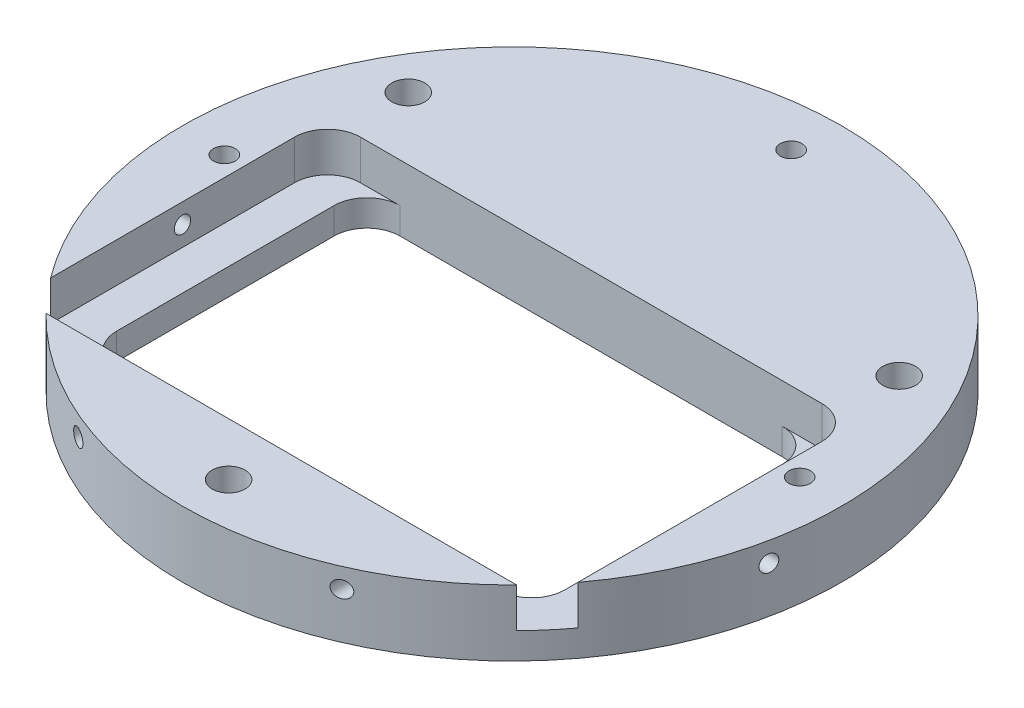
ISO-10303-21;
HEADER;
FILE_DESCRIPTION(('STEP AP214'),'2;1');
FILE_NAME('part.step','',(''),(''),'','','');
FILE_SCHEMA(('AUTOMOTIVE_DESIGN { 1 0 10303 214 1 1 1 1 }'));
ENDSEC;
DATA;
#1=APPLICATION_CONTEXT('core data for automotive mechanical design processes');
#2=APPLICATION_PROTOCOL_DEFINITION('international standard','automotive_design',2000,#1);
#3=PRODUCT_CONTEXT('',#1,'mechanical');
#4=PRODUCT('Part','Part','',(#3));
#5=PRODUCT_RELATED_PRODUCT_CATEGORY('part','',(#4));
#6=PRODUCT_DEFINITION_FORMATION('','',#4);
#7=PRODUCT_DEFINITION_CONTEXT('part definition',#1,'design');
#8=PRODUCT_DEFINITION('design','',#6,#7);
#9=PRODUCT_DEFINITION_SHAPE('','',#8);
#10=(LENGTH_UNIT() NAMED_UNIT(*) SI_UNIT(.MILLI.,.METRE.));
#11=(NAMED_UNIT(*) PLANE_ANGLE_UNIT() SI_UNIT($,.RADIAN.));
#12=(NAMED_UNIT(*) SI_UNIT($,.STERADIAN.) SOLID_ANGLE_UNIT());
#13=UNCERTAINTY_MEASURE_WITH_UNIT(LENGTH_MEASURE(1.E-05),#10,'distance_accuracy_value','');
#14=(GEOMETRIC_REPRESENTATION_CONTEXT(3) GLOBAL_UNCERTAINTY_ASSIGNED_CONTEXT((#13)) GLOBAL_UNIT_ASSIGNED_CONTEXT((#10,
#11,#12)) REPRESENTATION_CONTEXT('',''));
#15=CARTESIAN_POINT('',(0.,0.,0.));
#16=DIRECTION('',(0.,0.,1.));
#17=DIRECTION('',(1.,0.,0.));
#18=AXIS2_PLACEMENT_3D('',#15,#16,#17);
#19=CARTESIAN_POINT('',(-35.,4.,-7.));
#20=DIRECTION('',(0.,1.,0.));
#21=DIRECTION('',(0.,0.,1.));
#22=AXIS2_PLACEMENT_3D('',#19,#20,#21);
#23=CYLINDRICAL_SURFACE('',#22,5.);
#24=DIRECTION('',(0.,1.,0.));
#25=VECTOR('',#24,1.);
#26=CARTESIAN_POINT('',(-40.,4.,-6.99999999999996));
#27=LINE('',#26,#25);
#28=CARTESIAN_POINT('',(-40.,10.,-6.99999999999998));
#29=VERTEX_POINT('',#28);
#30=CARTESIAN_POINT('',(-40.,4.,-6.99999999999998));
#31=VERTEX_POINT('',#30);
#32=EDGE_CURVE('E148',#29,#31,#27,.F.);
#33=ORIENTED_EDGE('',*,*,#32,.T.);
#34=CARTESIAN_POINT('',(-35.,4.,-7.));
#35=DIRECTION('',(0.,1.,0.));
#36=DIRECTION('',(0.,0.,1.));
#37=AXIS2_PLACEMENT_3D('',#34,#35,#36);
#38=CIRCLE('',#37,5.);
#39=CARTESIAN_POINT('',(-35.,4.,-12.));
#40=VERTEX_POINT('',#39);
#41=EDGE_CURVE('E129',#31,#40,#38,.F.);
#42=ORIENTED_EDGE('',*,*,#41,.T.);
#43=DIRECTION('',(0.,1.,0.));
#44=VECTOR('',#43,1.);
#45=CARTESIAN_POINT('',(-35.,0.,-12.));
#46=LINE('',#45,#44);
#47=CARTESIAN_POINT('',(-35.,10.,-12.));
#48=VERTEX_POINT('',#47);
#49=EDGE_CURVE('E383',#40,#48,#46,.T.);
#50=ORIENTED_EDGE('',*,*,#49,.T.);
#51=CARTESIAN_POINT('',(-35.,10.,-7.));
#52=DIRECTION('',(0.,1.,0.));
#53=DIRECTION('',(0.,0.,1.));
#54=AXIS2_PLACEMENT_3D('',#51,#52,#53);
#55=CIRCLE('',#54,5.);
#56=EDGE_CURVE('E154',#29,#48,#55,.F.);
#57=ORIENTED_EDGE('',*,*,#56,.F.);
#58=EDGE_LOOP('',(#33,#42,#50,#57));
#59=FACE_BOUND('',#58,.T.);
#60=ADVANCED_FACE('F17',(#59),#23,.F.);
#61=CARTESIAN_POINT('',(35.,4.,-7.));
#62=DIRECTION('',(0.,1.,0.));
#63=DIRECTION('',(0.,0.,1.));
#64=AXIS2_PLACEMENT_3D('',#61,#62,#63);
#65=CYLINDRICAL_SURFACE('',#64,5.);
#66=DIRECTION('',(0.,1.,0.));
#67=VECTOR('',#66,1.);
#68=CARTESIAN_POINT('',(35.,0.,-12.));
#69=LINE('',#68,#67);
#70=CARTESIAN_POINT('',(35.,10.,-12.));
#71=VERTEX_POINT('',#70);
#72=CARTESIAN_POINT('',(35.,4.,-12.));
#73=VERTEX_POINT('',#72);
#74=EDGE_CURVE('E378',#71,#73,#69,.F.);
#75=ORIENTED_EDGE('',*,*,#74,.T.);
#76=CARTESIAN_POINT('',(35.,4.,-7.));
#77=DIRECTION('',(0.,1.,0.));
#78=DIRECTION('',(0.,0.,1.));
#79=AXIS2_PLACEMENT_3D('',#76,#77,#78);
#80=CIRCLE('',#79,5.);
#81=CARTESIAN_POINT('',(40.,4.,-6.99999999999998));
#82=VERTEX_POINT('',#81);
#83=EDGE_CURVE('E141',#73,#82,#80,.F.);
#84=ORIENTED_EDGE('',*,*,#83,.T.);
#85=DIRECTION('',(0.,1.,0.));
#86=VECTOR('',#85,1.);
#87=CARTESIAN_POINT('',(40.,4.,-6.99999999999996));
#88=LINE('',#87,#86);
#89=CARTESIAN_POINT('',(40.,10.,-6.99999999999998));
#90=VERTEX_POINT('',#89);
#91=EDGE_CURVE('E160',#82,#90,#88,.T.);
#92=ORIENTED_EDGE('',*,*,#91,.T.);
#93=CARTESIAN_POINT('',(35.,10.,-7.));
#94=DIRECTION('',(0.,1.,0.));
#95=DIRECTION('',(0.,0.,1.));
#96=AXIS2_PLACEMENT_3D('',#93,#94,#95);
#97=CIRCLE('',#96,5.);
#98=EDGE_CURVE('E298',#71,#90,#97,.F.);
#99=ORIENTED_EDGE('',*,*,#98,.F.);
#100=EDGE_LOOP('',(#75,#84,#92,#99));
#101=FACE_BOUND('',#100,.T.);
#102=ADVANCED_FACE('F243',(#101),#65,.F.);
#103=CARTESIAN_POINT('',(20.,7.,31.));
#104=DIRECTION('',(0.,0.,-1.));
#105=DIRECTION('',(-1.,0.,0.));
#106=AXIS2_PLACEMENT_3D('',#103,#104,#105);
#107=CYLINDRICAL_SURFACE('',#106,1.24999999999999);
#108=CARTESIAN_POINT('',(20.,7.,35.));
#109=DIRECTION('',(0.,0.,-1.));
#110=DIRECTION('',(-1.,0.,0.));
#111=AXIS2_PLACEMENT_3D('',#108,#109,#110);
#112=CIRCLE('',#111,1.24999999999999);
#113=CARTESIAN_POINT('',(18.75,7.,35.));
#114=VERTEX_POINT('',#113);
#115=EDGE_CURVE('E302',#114,#114,#112,.T.);
#116=ORIENTED_EDGE('',*,*,#115,.T.);
#117=EDGE_LOOP('',(#116));
#118=FACE_BOUND('',#117,.T.);
#119=CARTESIAN_POINT('',(21.25,6.99999999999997,45.2596674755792));
#120=CARTESIAN_POINT('',(21.2499922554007,6.9346349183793,45.259671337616));
#121=CARTESIAN_POINT('',(21.2448432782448,6.86918883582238,45.2620897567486));
#122=CARTESIAN_POINT('',(21.2244435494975,6.74014169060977,45.2716590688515));
#123=CARTESIAN_POINT('',(21.2091690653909,6.67654532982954,45.2788210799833));
#124=CARTESIAN_POINT('',(21.1692361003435,6.55326708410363,45.2975046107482));
#125=CARTESIAN_POINT('',(21.1446052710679,6.4935742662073,45.3090132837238));
#126=CARTESIAN_POINT('',(21.0869415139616,6.37939470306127,45.3358787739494));
#127=CARTESIAN_POINT('',(21.0539114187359,6.32490621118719,45.3512342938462));
#128=CARTESIAN_POINT('',(20.9791062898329,6.22015550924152,45.3858883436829));
#129=CARTESIAN_POINT('',(20.9370332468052,6.1701510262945,45.4053204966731));
#130=CARTESIAN_POINT('',(20.8463576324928,6.07784527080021,45.447022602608));
#131=CARTESIAN_POINT('',(20.7977524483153,6.03554709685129,45.469293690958));
#132=CARTESIAN_POINT('',(20.6907389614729,5.95586489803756,45.5180961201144));
#133=CARTESIAN_POINT('',(20.6318425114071,5.91926073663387,45.5448303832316));
#134=CARTESIAN_POINT('',(20.5094960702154,5.85647618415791,45.6000557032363));
#135=CARTESIAN_POINT('',(20.4460443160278,5.83029985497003,45.6285474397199));
#136=CARTESIAN_POINT('',(20.3108075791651,5.78701131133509,45.68891560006));
#137=CARTESIAN_POINT('',(20.2387658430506,5.77081785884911,45.7208780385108));
#138=CARTESIAN_POINT('',(20.0930750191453,5.7513036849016,45.7850923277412));
#139=CARTESIAN_POINT('',(20.0194254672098,5.74798673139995,45.8173442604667));
#140=CARTESIAN_POINT('',(19.8694255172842,5.75448354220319,45.8825989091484));
#141=CARTESIAN_POINT('',(19.79308756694,5.76483873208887,45.9155785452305));
#142=CARTESIAN_POINT('',(19.6429790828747,5.7995957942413,45.9799961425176));
#143=CARTESIAN_POINT('',(19.5692086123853,5.8239980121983,46.0114340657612));
#144=CARTESIAN_POINT('',(19.4278504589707,5.88599951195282,46.0712971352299));
#145=CARTESIAN_POINT('',(19.3601776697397,5.92336231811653,46.0997651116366));
#146=CARTESIAN_POINT('',(19.2320225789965,6.01069967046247,46.1533761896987));
#147=CARTESIAN_POINT('',(19.1715369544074,6.06066835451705,46.1785208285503));
#148=CARTESIAN_POINT('',(19.0638741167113,6.16838497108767,46.2230665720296));
#149=CARTESIAN_POINT('',(19.0160847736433,6.22540917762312,46.2427359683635));
#150=CARTESIAN_POINT('',(18.930907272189,6.34800106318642,46.2776714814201));
#151=CARTESIAN_POINT('',(18.893518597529,6.41356831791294,46.2929378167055));
#152=CARTESIAN_POINT('',(18.8334007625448,6.54569205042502,46.3174264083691));
#153=CARTESIAN_POINT('',(18.8097438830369,6.61175732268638,46.3270320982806));
#154=CARTESIAN_POINT('',(18.773816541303,6.74729034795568,46.3416032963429));
#155=CARTESIAN_POINT('',(18.7615150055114,6.81674826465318,46.3465814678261));
#156=CARTESIAN_POINT('',(18.753429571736,6.90554267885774,46.3498530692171));
#157=CARTESIAN_POINT('',(18.7521446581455,6.9244052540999,46.3503729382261));
#158=CARTESIAN_POINT('',(18.7504294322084,6.96217593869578,46.3510668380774));
#159=CARTESIAN_POINT('',(18.7499991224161,6.98108404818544,46.3512408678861));
#160=CARTESIAN_POINT('',(18.7500030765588,7.06631393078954,46.3512394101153));
#161=CARTESIAN_POINT('',(18.7553054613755,7.13272424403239,46.3490954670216));
#162=CARTESIAN_POINT('',(18.7763236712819,7.26369134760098,46.3405847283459));
#163=CARTESIAN_POINT('',(18.7920627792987,7.3282436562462,46.3342084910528));
#164=CARTESIAN_POINT('',(18.8332866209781,7.45344334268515,46.3174676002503));
#165=CARTESIAN_POINT('',(18.8587489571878,7.51409932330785,46.307112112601));
#166=CARTESIAN_POINT('',(18.918445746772,7.63007575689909,46.2827553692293));
#167=CARTESIAN_POINT('',(18.9526769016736,7.68539820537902,46.2687554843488));
#168=CARTESIAN_POINT('',(19.0298466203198,7.7910137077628,46.2370708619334));
#169=CARTESIAN_POINT('',(19.0730090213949,7.84111424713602,46.2192909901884));
#170=CARTESIAN_POINT('',(19.1659860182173,7.93338893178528,46.1808132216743));
#171=CARTESIAN_POINT('',(19.2158028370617,7.97556041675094,46.1601143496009));
#172=CARTESIAN_POINT('',(19.3242966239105,8.05390018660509,46.1148050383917));
#173=CARTESIAN_POINT('',(19.3833483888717,8.08944971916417,46.0900229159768));
#174=CARTESIAN_POINT('',(19.5057188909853,8.15015482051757,46.0383681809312));
#175=CARTESIAN_POINT('',(19.5690390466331,8.17530691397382,46.0114948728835));
#176=CARTESIAN_POINT('',(19.7031803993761,8.21642068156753,45.9542205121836));
#177=CARTESIAN_POINT('',(19.7742080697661,8.23155205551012,45.9237060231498));
#178=CARTESIAN_POINT('',(19.9174260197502,8.24935714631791,45.8617731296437));
#179=CARTESIAN_POINT('',(19.9896166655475,8.2520268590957,45.8303544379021));
#180=CARTESIAN_POINT('',(20.1372007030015,8.24475747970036,45.7657074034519));
#181=CARTESIAN_POINT('',(20.2125584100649,8.23413502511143,45.7324723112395));
#182=CARTESIAN_POINT('',(20.3604615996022,8.1993086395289,45.6668167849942));
#183=CARTESIAN_POINT('',(20.4330065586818,8.17510219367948,45.6343965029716));
#184=CARTESIAN_POINT('',(20.573498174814,8.11333577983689,45.5712314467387));
#185=CARTESIAN_POINT('',(20.6414200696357,8.07570975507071,45.5404958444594));
#186=CARTESIAN_POINT('',(20.7699724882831,7.98777541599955,45.4820099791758));
#187=CARTESIAN_POINT('',(20.8306054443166,7.93747134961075,45.4542587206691));
#188=CARTESIAN_POINT('',(20.9390387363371,7.82842193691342,45.4044053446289));
#189=CARTESIAN_POINT('',(20.987369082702,7.77031062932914,45.3820732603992));
#190=CARTESIAN_POINT('',(21.0733330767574,7.64514216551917,45.3422197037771));
#191=CARTESIAN_POINT('',(21.1109688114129,7.57808675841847,45.3246972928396));
#192=CARTESIAN_POINT('',(21.1706518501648,7.44380273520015,45.2968485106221));
#193=CARTESIAN_POINT('',(21.1938333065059,7.377184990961,45.2859999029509));
#194=CARTESIAN_POINT('',(21.2286573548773,7.2405035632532,45.2696862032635));
#195=CARTESIAN_POINT('',(21.2403349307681,7.17045101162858,45.2642047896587));
#196=CARTESIAN_POINT('',(21.2486691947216,7.06668804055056,45.2602922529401));
#197=CARTESIAN_POINT('',(21.2500039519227,7.03335456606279,45.2596655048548));
#198=CARTESIAN_POINT('',(21.25,6.99999999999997,45.2596674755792));
#199=B_SPLINE_CURVE_WITH_KNOTS('',3,(#119,#120,#121,#122,#123,#124,#125,#126,#127,#128,#129,
#130,#131,#132,#133,#134,#135,#136,#137,#138,#139,#140,#141,#142,#143,#144,#145,#146,#147,#148,
#149,#150,#151,#152,#153,#154,#155,#156,#157,#158,#159,#160,#161,#162,#163,#164,#165,#166,#167,
#168,#169,#170,#171,#172,#173,#174,#175,#176,#177,#178,#179,#180,#181,#182,#183,#184,#185,#186,
#187,#188,#189,#190,#191,#192,#193,#194,#195,#196,#197,#198),.UNSPECIFIED.,.T.,.F.,(4,2,2,2,2,2,
2,2,2,2,2,2,2,2,2,2,2,2,2,2,2,2,2,2,2,2,2,2,2,2,2,2,2,2,2,2,2,2,2,4),(0.,0.195993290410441,
0.392447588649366,0.588325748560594,0.78413793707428,0.98781665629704,1.19157709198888,
1.41359412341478,1.63569755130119,1.87600506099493,2.11638288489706,2.36657118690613,
2.61676564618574,2.86261636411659,3.10835296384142,3.33799712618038,3.5676298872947,
3.77904387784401,3.98987761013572,4.04660386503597,4.10333028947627,4.3021969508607,
4.50150875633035,4.7003641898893,4.89914493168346,5.10369359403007,5.30831076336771,
5.52711139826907,5.74598510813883,5.98126654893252,6.21662358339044,6.46459320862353,
6.71260875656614,6.96186238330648,7.21103260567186,7.44618609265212,7.68129365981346,
7.89426272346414,8.10658211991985,8.20659379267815),.UNSPECIFIED.);
#200=CARTESIAN_POINT('',(21.25,6.99999999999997,45.2596674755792));
#201=VERTEX_POINT('',#200);
#202=EDGE_CURVE('E230',#201,#201,#199,.T.);
#203=ORIENTED_EDGE('',*,*,#202,.F.);
#204=EDGE_LOOP('',(#203));
#205=FACE_BOUND('',#204,.T.);
#206=ADVANCED_FACE('F239',(#118,#205),#107,.F.);
#207=CARTESIAN_POINT('',(40.,7.,9.99999999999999));
#208=DIRECTION('',(-1.,0.,0.));
#209=DIRECTION('',(0.,0.,1.));
#210=AXIS2_PLACEMENT_3D('',#207,#208,#209);
#211=CYLINDRICAL_SURFACE('',#210,1.24999999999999);
#212=CARTESIAN_POINT('',(40.,7.,9.99999999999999));
#213=DIRECTION('',(-1.,0.,0.));
#214=DIRECTION('',(0.,0.,1.));
#215=AXIS2_PLACEMENT_3D('',#212,#213,#214);
#216=CIRCLE('',#215,1.24999999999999);
#217=CARTESIAN_POINT('',(40.,7.,11.25));
#218=VERTEX_POINT('',#217);
#219=EDGE_CURVE('E20',#218,#218,#216,.T.);
#220=ORIENTED_EDGE('',*,*,#219,.T.);
#221=EDGE_LOOP('',(#220));
#222=FACE_BOUND('',#221,.T.);
#223=CARTESIAN_POINT('',(49.228421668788,7.000000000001,8.75));
#224=CARTESIAN_POINT('',(49.2284212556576,6.93068005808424,8.75000298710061));
#225=CARTESIAN_POINT('',(49.2273934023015,6.86126604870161,8.75579123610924));
#226=CARTESIAN_POINT('',(49.2232960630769,6.72431971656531,8.77879583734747));
#227=CARTESIAN_POINT('',(49.2202222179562,6.6567917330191,8.79603659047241));
#228=CARTESIAN_POINT('',(49.2120927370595,6.5256990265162,8.84140575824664));
#229=CARTESIAN_POINT('',(49.2070393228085,6.46212995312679,8.86952196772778));
#230=CARTESIAN_POINT('',(49.1950521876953,6.34068490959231,8.93576899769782));
#231=CARTESIAN_POINT('',(49.1881193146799,6.28280638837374,8.9738953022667));
#232=CARTESIAN_POINT('',(49.1724616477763,6.17392523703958,9.05929944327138));
#233=CARTESIAN_POINT('',(49.1637257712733,6.12296852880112,9.10663377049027));
#234=CARTESIAN_POINT('',(49.1446717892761,6.02971147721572,9.20890523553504));
#235=CARTESIAN_POINT('',(49.1343534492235,5.98741241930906,9.26384350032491));
#236=CARTESIAN_POINT('',(49.11219603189,5.91199594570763,9.38060649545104));
#237=CARTESIAN_POINT('',(49.1003367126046,5.87902364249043,9.44252109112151));
#238=CARTESIAN_POINT('',(49.0754954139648,5.82392512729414,9.57078967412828));
#239=CARTESIAN_POINT('',(49.062513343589,5.8017997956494,9.63714402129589));
#240=CARTESIAN_POINT('',(49.0355115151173,5.76863335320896,9.77361382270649));
#241=CARTESIAN_POINT('',(49.0214778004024,5.75778841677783,9.84377420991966));
#242=CARTESIAN_POINT('',(48.992942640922,5.74809408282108,9.98482598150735));
#243=CARTESIAN_POINT('',(48.978441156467,5.74924570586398,10.0557174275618));
#244=CARTESIAN_POINT('',(48.9491860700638,5.76357837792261,10.1971793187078));
#245=CARTESIAN_POINT('',(48.9344316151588,5.77691303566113,10.2677340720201));
#246=CARTESIAN_POINT('',(48.9053001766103,5.81547058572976,10.4056034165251));
#247=CARTESIAN_POINT('',(48.8909232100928,5.8406940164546,10.4729178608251));
#248=CARTESIAN_POINT('',(48.8629921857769,5.90241911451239,10.6024712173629));
#249=CARTESIAN_POINT('',(48.8494392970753,5.93893637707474,10.6647029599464));
#250=CARTESIAN_POINT('',(48.8236529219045,6.02227806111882,10.7821396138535));
#251=CARTESIAN_POINT('',(48.8114192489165,6.06910102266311,10.8373455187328));
#252=CARTESIAN_POINT('',(48.7888860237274,6.17108435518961,10.9383384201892));
#253=CARTESIAN_POINT('',(48.7785623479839,6.22612218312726,10.9842437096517));
#254=CARTESIAN_POINT('',(48.7600502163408,6.34350710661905,11.0661317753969));
#255=CARTESIAN_POINT('',(48.7518625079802,6.4058567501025,11.1021110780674));
#256=CARTESIAN_POINT('',(48.7381315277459,6.53454727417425,11.1622340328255));
#257=CARTESIAN_POINT('',(48.7325327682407,6.60076639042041,11.1866263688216));
#258=CARTESIAN_POINT('',(48.7239595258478,6.7364230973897,11.223909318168));
#259=CARTESIAN_POINT('',(48.7209789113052,6.80585276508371,11.2368268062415));
#260=CARTESIAN_POINT('',(48.7188903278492,6.89643623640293,11.2458759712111));
#261=CARTESIAN_POINT('',(48.7185335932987,6.91711480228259,11.2474212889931));
#262=CARTESIAN_POINT('',(48.7180573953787,6.958526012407,11.2494837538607));
#263=CARTESIAN_POINT('',(48.7179379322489,6.97925865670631,11.2500008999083));
#264=CARTESIAN_POINT('',(48.7179389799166,7.06886194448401,11.2499970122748));
#265=CARTESIAN_POINT('',(48.7192592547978,7.13781977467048,11.2442838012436));
#266=CARTESIAN_POINT('',(48.7244916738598,7.2738540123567,11.2215882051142));
#267=CARTESIAN_POINT('',(48.728409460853,7.34092599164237,11.2045812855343));
#268=CARTESIAN_POINT('',(48.7386698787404,7.47110548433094,11.1598647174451));
#269=CARTESIAN_POINT('',(48.7450090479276,7.5342185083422,11.1321703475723));
#270=CARTESIAN_POINT('',(48.7598550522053,7.65482183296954,11.0669619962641));
#271=CARTESIAN_POINT('',(48.7683609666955,7.71231450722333,11.0294521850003));
#272=CARTESIAN_POINT('',(48.7873342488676,7.82087179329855,10.9452225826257));
#273=CARTESIAN_POINT('',(48.7978240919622,7.8718502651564,10.8983969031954));
#274=CARTESIAN_POINT('',(48.8203171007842,7.96526257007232,10.7971904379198));
#275=CARTESIAN_POINT('',(48.8323205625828,8.00769472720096,10.7428081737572));
#276=CARTESIAN_POINT('',(48.8577341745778,8.08386479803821,10.6266374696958));
#277=CARTESIAN_POINT('',(48.8711709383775,8.11737260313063,10.5647039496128));
#278=CARTESIAN_POINT('',(48.8987656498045,8.17350457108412,10.4362364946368));
#279=CARTESIAN_POINT('',(48.9129236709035,8.19612762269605,10.3697020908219));
#280=CARTESIAN_POINT('',(48.9418000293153,8.23024550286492,10.2325563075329));
#281=CARTESIAN_POINT('',(48.9565238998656,8.24152161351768,10.1618915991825));
#282=CARTESIAN_POINT('',(48.9858348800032,8.25187868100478,10.0196434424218));
#283=CARTESIAN_POINT('',(49.0004219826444,8.25095902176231,9.94805994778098));
#284=CARTESIAN_POINT('',(49.0291341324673,8.2368723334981,9.80557587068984));
#285=CARTESIAN_POINT('',(49.0432560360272,8.22363482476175,9.73468159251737));
#286=CARTESIAN_POINT('',(49.0705694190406,8.18511635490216,9.59605182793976));
#287=CARTESIAN_POINT('',(49.0837609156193,8.15983561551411,9.52831628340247));
#288=CARTESIAN_POINT('',(49.1087743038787,8.09812159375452,9.39854366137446));
#289=CARTESIAN_POINT('',(49.1206063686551,8.0617797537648,9.33646509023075));
#290=CARTESIAN_POINT('',(49.1427351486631,7.97884042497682,9.21928102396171));
#291=CARTESIAN_POINT('',(49.153032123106,7.93224467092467,9.16417435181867));
#292=CARTESIAN_POINT('',(49.1716983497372,7.83093193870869,9.06347985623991));
#293=CARTESIAN_POINT('',(49.1800964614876,7.77636076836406,9.01775067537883));
#294=CARTESIAN_POINT('',(49.1949986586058,7.66004524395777,8.93609738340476));
#295=CARTESIAN_POINT('',(49.2015020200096,7.59829816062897,8.90017702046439));
#296=CARTESIAN_POINT('',(49.2123855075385,7.47048236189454,8.83979879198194));
#297=CARTESIAN_POINT('',(49.2167976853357,7.40449776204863,8.8151680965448));
#298=CARTESIAN_POINT('',(49.2235559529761,7.26932881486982,8.77735234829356));
#299=CARTESIAN_POINT('',(49.2259066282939,7.20015193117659,8.76414189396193));
#300=CARTESIAN_POINT('',(49.2276127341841,7.1087718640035,8.75455003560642));
#301=CARTESIAN_POINT('',(49.2279159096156,7.08705614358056,8.75284505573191));
#302=CARTESIAN_POINT('',(49.2283204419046,7.04356337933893,8.7505695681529));
#303=CARTESIAN_POINT('',(49.2284217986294,7.02178633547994,8.74999906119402));
#304=CARTESIAN_POINT('',(49.228421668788,7.000000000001,8.75));
#305=B_SPLINE_CURVE_WITH_KNOTS('',3,(#223,#224,#225,#226,#227,#228,#229,#230,#231,#232,#233,
#234,#235,#236,#237,#238,#239,#240,#241,#242,#243,#244,#245,#246,#247,#248,#249,#250,#251,#252,
#253,#254,#255,#256,#257,#258,#259,#260,#261,#262,#263,#264,#265,#266,#267,#268,#269,#270,#271,
#272,#273,#274,#275,#276,#277,#278,#279,#280,#281,#282,#283,#284,#285,#286,#287,#288,#289,#290,
#291,#292,#293,#294,#295,#296,#297,#298,#299,#300,#301,#302,#303,#304),.UNSPECIFIED.,.T.,.F.,(4,
2,2,2,2,2,2,2,2,2,2,2,2,2,2,2,2,2,2,2,2,2,2,2,2,2,2,2,2,2,2,2,2,2,2,2,2,2,2,2,4),(0.,
0.207876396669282,0.416197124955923,0.624284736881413,0.832278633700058,1.04159127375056,
1.25093496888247,1.46337612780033,1.67583452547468,1.89192891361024,2.10804168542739,
2.32691747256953,2.54580317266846,2.76499248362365,2.98415076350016,3.2003172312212,
3.41655925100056,3.62792320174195,3.83879081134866,3.90099063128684,3.96319051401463,
4.16969617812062,4.37665192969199,4.58331290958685,4.789886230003,4.998957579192,
5.20806988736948,5.42214248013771,5.63623692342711,5.85438334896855,6.07254079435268,
6.2919542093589,6.51136358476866,6.72900621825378,6.94661205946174,7.16064719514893,
7.37476400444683,7.5854834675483,7.79573302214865,7.86106576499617,7.92639855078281),.UNSPECIFIED.);
#306=CARTESIAN_POINT('',(49.228421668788,7.000000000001,8.75));
#307=VERTEX_POINT('',#306);
#308=EDGE_CURVE('E224',#307,#307,#305,.T.);
#309=ORIENTED_EDGE('',*,*,#308,.F.);
#310=EDGE_LOOP('',(#309));
#311=FACE_BOUND('',#310,.T.);
#312=ADVANCED_FACE('F242',(#222,#311),#211,.F.);
#313=CARTESIAN_POINT('',(40.,4.,-6.99999999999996));
#314=DIRECTION('',(1.,0.,0.));
#315=DIRECTION('',(0.,0.,-1.));
#316=AXIS2_PLACEMENT_3D('',#313,#314,#315);
#317=PLANE('',#316);
#318=ORIENTED_EDGE('',*,*,#91,.F.);
#319=DIRECTION('',(0.,0.,-1.));
#320=VECTOR('',#319,1.);
#321=CARTESIAN_POINT('',(40.,4.,-7.));
#322=LINE('',#321,#320);
#323=CARTESIAN_POINT('',(40.,4.,30.));
#324=VERTEX_POINT('',#323);
#325=EDGE_CURVE('E155',#82,#324,#322,.F.);
#326=ORIENTED_EDGE('',*,*,#325,.T.);
#327=DIRECTION('',(0.,-1.,0.));
#328=VECTOR('',#327,1.);
#329=CARTESIAN_POINT('',(40.,10.,30.));
#330=LINE('',#329,#328);
#331=CARTESIAN_POINT('',(40.,10.,30.));
#332=VERTEX_POINT('',#331);
#333=EDGE_CURVE('E362',#332,#324,#330,.T.);
#334=ORIENTED_EDGE('',*,*,#333,.F.);
#335=DIRECTION('',(0.,0.,1.));
#336=VECTOR('',#335,1.);
#337=CARTESIAN_POINT('',(40.,10.,0.));
#338=LINE('',#337,#336);
#339=EDGE_CURVE('E297',#90,#332,#338,.T.);
#340=ORIENTED_EDGE('',*,*,#339,.F.);
#341=EDGE_LOOP('',(#318,#326,#334,#340));
#342=FACE_BOUND('',#341,.T.);
#343=ORIENTED_EDGE('',*,*,#219,.F.);
#344=EDGE_LOOP('',(#343));
#345=FACE_BOUND('',#344,.T.);
#346=ADVANCED_FACE('F315',(#342,#345),#317,.F.);
#347=CARTESIAN_POINT('',(0.,10.,0.));
#348=DIRECTION('',(0.,1.,0.));
#349=DIRECTION('',(0.,0.,1.));
#350=AXIS2_PLACEMENT_3D('',#347,#348,#349);
#351=PLANE('',#350);
#352=CARTESIAN_POINT('',(0.,10.,0.));
#353=DIRECTION('',(0.,-1.,0.));
#354=DIRECTION('',(0.,0.,-1.));
#355=AXIS2_PLACEMENT_3D('',#352,#353,#354);
#356=CIRCLE('',#355,50.);
#357=CARTESIAN_POINT('',(35.7071421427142,10.,35.));
#358=VERTEX_POINT('',#357);
#359=CARTESIAN_POINT('',(-35.7071421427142,10.,35.));
#360=VERTEX_POINT('',#359);
#361=EDGE_CURVE('E358',#358,#360,#356,.T.);
#362=ORIENTED_EDGE('',*,*,#361,.F.);
#363=DIRECTION('',(1.,0.,0.));
#364=VECTOR('',#363,1.);
#365=CARTESIAN_POINT('',(-40.,10.,35.));
#366=LINE('',#365,#364);
#367=EDGE_CURVE('E304',#358,#360,#366,.F.);
#368=ORIENTED_EDGE('',*,*,#367,.T.);
#369=EDGE_LOOP('',(#362,#368));
#370=FACE_BOUND('',#369,.T.);
#371=CARTESIAN_POINT('',(0.,10.,43.));
#372=DIRECTION('',(0.,1.,0.));
#373=DIRECTION('',(0.,0.,1.));
#374=AXIS2_PLACEMENT_3D('',#371,#372,#373);
#375=CIRCLE('',#374,2.5);
#376=CARTESIAN_POINT('',(0.,10.,45.5));
#377=VERTEX_POINT('',#376);
#378=EDGE_CURVE('E402',#377,#377,#375,.F.);
#379=ORIENTED_EDGE('',*,*,#378,.T.);
#380=EDGE_LOOP('',(#379));
#381=FACE_BOUND('',#380,.T.);
#382=ADVANCED_FACE('F317',(#370,#381),#351,.T.);
#383=CARTESIAN_POINT('',(-40.,4.,35.));
#384=DIRECTION('',(0.,0.,1.));
#385=DIRECTION('',(1.,0.,0.));
#386=AXIS2_PLACEMENT_3D('',#383,#384,#385);
#387=PLANE('',#386);
#388=DIRECTION('',(0.,-1.,0.));
#389=VECTOR('',#388,1.);
#390=CARTESIAN_POINT('',(35.7071421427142,10.,35.));
#391=LINE('',#390,#389);
#392=CARTESIAN_POINT('',(35.7071421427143,4.,35.));
#393=VERTEX_POINT('',#392);
#394=EDGE_CURVE('E359',#393,#358,#391,.F.);
#395=ORIENTED_EDGE('',*,*,#394,.F.);
#396=DIRECTION('',(1.,0.,0.));
#397=VECTOR('',#396,1.);
#398=CARTESIAN_POINT('',(-35.,4.,35.));
#399=LINE('',#398,#397);
#400=CARTESIAN_POINT('',(-35.7071421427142,4.,35.));
#401=VERTEX_POINT('',#400);
#402=EDGE_CURVE('E142',#393,#401,#399,.F.);
#403=ORIENTED_EDGE('',*,*,#402,.T.);
#404=DIRECTION('',(0.,-1.,0.));
#405=VECTOR('',#404,1.);
#406=CARTESIAN_POINT('',(-35.7071421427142,10.,35.));
#407=LINE('',#406,#405);
#408=EDGE_CURVE('E357',#360,#401,#407,.T.);
#409=ORIENTED_EDGE('',*,*,#408,.F.);
#410=ORIENTED_EDGE('',*,*,#367,.F.);
#411=EDGE_LOOP('',(#395,#403,#409,#410));
#412=FACE_BOUND('',#411,.T.);
#413=ORIENTED_EDGE('',*,*,#115,.F.);
#414=EDGE_LOOP('',(#413));
#415=FACE_BOUND('',#414,.T.);
#416=CARTESIAN_POINT('',(-20.,7.,35.));
#417=DIRECTION('',(0.,0.,-1.));
#418=DIRECTION('',(-1.,0.,0.));
#419=AXIS2_PLACEMENT_3D('',#416,#417,#418);
#420=CIRCLE('',#419,1.24999999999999);
#421=CARTESIAN_POINT('',(-21.25,7.,35.));
#422=VERTEX_POINT('',#421);
#423=EDGE_CURVE('E285',#422,#422,#420,.F.);
#424=ORIENTED_EDGE('',*,*,#423,.T.);
#425=EDGE_LOOP('',(#424));
#426=FACE_BOUND('',#425,.T.);
#427=ADVANCED_FACE('F323',(#412,#415,#426),#387,.F.);
#428=CARTESIAN_POINT('',(-35.,4.,-7.));
#429=DIRECTION('',(0.,-1.,0.));
#430=DIRECTION('',(0.,0.,-1.));
#431=AXIS2_PLACEMENT_3D('',#428,#429,#430);
#432=PLANE('',#431);
#433=ORIENTED_EDGE('',*,*,#83,.F.);
#434=DIRECTION('',(-1.,0.,0.));
#435=VECTOR('',#434,1.);
#436=CARTESIAN_POINT('',(-29.,4.,-12.));
#437=LINE('',#436,#435);
#438=CARTESIAN_POINT('',(29.,4.,-12.));
#439=VERTEX_POINT('',#438);
#440=EDGE_CURVE('E375',#73,#439,#437,.T.);
#441=ORIENTED_EDGE('',*,*,#440,.T.);
#442=CARTESIAN_POINT('',(29.,4.,-7.));
#443=DIRECTION('',(0.,1.,0.));
#444=DIRECTION('',(0.,0.,1.));
#445=AXIS2_PLACEMENT_3D('',#442,#443,#444);
#446=CIRCLE('',#445,5.);
#447=CARTESIAN_POINT('',(34.,4.,-6.99999999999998));
#448=VERTEX_POINT('',#447);
#449=EDGE_CURVE('E237',#439,#448,#446,.F.);
#450=ORIENTED_EDGE('',*,*,#449,.T.);
#451=DIRECTION('',(0.,0.,-1.));
#452=VECTOR('',#451,1.);
#453=CARTESIAN_POINT('',(34.,4.,-6.99999999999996));
#454=LINE('',#453,#452);
#455=CARTESIAN_POINT('',(34.,4.,26.));
#456=VERTEX_POINT('',#455);
#457=EDGE_CURVE('E372',#448,#456,#454,.F.);
#458=ORIENTED_EDGE('',*,*,#457,.T.);
#459=CARTESIAN_POINT('',(29.,4.,26.));
#460=DIRECTION('',(0.,1.,0.));
#461=DIRECTION('',(0.,0.,1.));
#462=AXIS2_PLACEMENT_3D('',#459,#460,#461);
#463=CIRCLE('',#462,5.);
#464=CARTESIAN_POINT('',(29.,4.,31.));
#465=VERTEX_POINT('',#464);
#466=EDGE_CURVE('E399',#456,#465,#463,.F.);
#467=ORIENTED_EDGE('',*,*,#466,.T.);
#468=DIRECTION('',(1.,0.,0.));
#469=VECTOR('',#468,1.);
#470=CARTESIAN_POINT('',(-29.,4.,31.));
#471=LINE('',#470,#469);
#472=CARTESIAN_POINT('',(-29.,4.,31.));
#473=VERTEX_POINT('',#472);
#474=EDGE_CURVE('E390',#465,#473,#471,.F.);
#475=ORIENTED_EDGE('',*,*,#474,.T.);
#476=CARTESIAN_POINT('',(-29.,4.,26.));
#477=DIRECTION('',(0.,1.,0.));
#478=DIRECTION('',(0.,0.,1.));
#479=AXIS2_PLACEMENT_3D('',#476,#477,#478);
#480=CIRCLE('',#479,5.);
#481=CARTESIAN_POINT('',(-34.,4.,26.));
#482=VERTEX_POINT('',#481);
#483=EDGE_CURVE('E396',#473,#482,#480,.F.);
#484=ORIENTED_EDGE('',*,*,#483,.T.);
#485=DIRECTION('',(0.,0.,1.));
#486=VECTOR('',#485,1.);
#487=CARTESIAN_POINT('',(-34.,4.,-6.99999999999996));
#488=LINE('',#487,#486);
#489=CARTESIAN_POINT('',(-34.,4.,-6.99999999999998));
#490=VERTEX_POINT('',#489);
#491=EDGE_CURVE('E387',#482,#490,#488,.F.);
#492=ORIENTED_EDGE('',*,*,#491,.T.);
#493=CARTESIAN_POINT('',(-29.,4.,-7.));
#494=DIRECTION('',(0.,1.,0.));
#495=DIRECTION('',(0.,0.,1.));
#496=AXIS2_PLACEMENT_3D('',#493,#494,#495);
#497=CIRCLE('',#496,5.);
#498=CARTESIAN_POINT('',(-29.,4.,-12.));
#499=VERTEX_POINT('',#498);
#500=EDGE_CURVE('E489',#490,#499,#497,.F.);
#501=ORIENTED_EDGE('',*,*,#500,.T.);
#502=DIRECTION('',(-1.,0.,0.));
#503=VECTOR('',#502,1.);
#504=CARTESIAN_POINT('',(-29.,4.,-12.));
#505=LINE('',#504,#503);
#506=EDGE_CURVE('E136',#499,#40,#505,.T.);
#507=ORIENTED_EDGE('',*,*,#506,.T.);
#508=ORIENTED_EDGE('',*,*,#41,.F.);
#509=DIRECTION('',(0.,0.,1.));
#510=VECTOR('',#509,1.);
#511=CARTESIAN_POINT('',(-40.,4.,-6.99999999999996));
#512=LINE('',#511,#510);
#513=CARTESIAN_POINT('',(-40.,4.,30.));
#514=VERTEX_POINT('',#513);
#515=EDGE_CURVE('E133',#31,#514,#512,.T.);
#516=ORIENTED_EDGE('',*,*,#515,.T.);
#517=CARTESIAN_POINT('',(0.,4.,0.));
#518=DIRECTION('',(0.,-1.,0.));
#519=DIRECTION('',(0.,0.,-1.));
#520=AXIS2_PLACEMENT_3D('',#517,#518,#519);
#521=CIRCLE('',#520,50.);
#522=EDGE_CURVE('E353',#401,#514,#521,.T.);
#523=ORIENTED_EDGE('',*,*,#522,.F.);
#524=ORIENTED_EDGE('',*,*,#402,.F.);
#525=CARTESIAN_POINT('',(0.,4.,0.));
#526=DIRECTION('',(0.,-1.,0.));
#527=DIRECTION('',(0.,0.,-1.));
#528=AXIS2_PLACEMENT_3D('',#525,#526,#527);
#529=CIRCLE('',#528,50.);
#530=EDGE_CURVE('E360',#324,#393,#529,.T.);
#531=ORIENTED_EDGE('',*,*,#530,.F.);
#532=ORIENTED_EDGE('',*,*,#325,.F.);
#533=EDGE_LOOP('',(#433,#441,#450,#458,#467,#475,#484,#492,#501,#507,#508,#516,#523,#524,#531,#532));
#534=FACE_BOUND('',#533,.T.);
#535=ADVANCED_FACE('F131',(#534),#432,.F.);
#536=CARTESIAN_POINT('',(-40.,4.,-6.99999999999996));
#537=DIRECTION('',(-1.,0.,0.));
#538=DIRECTION('',(0.,0.,1.));
#539=AXIS2_PLACEMENT_3D('',#536,#537,#538);
#540=PLANE('',#539);
#541=ORIENTED_EDGE('',*,*,#32,.F.);
#542=DIRECTION('',(0.,0.,1.));
#543=VECTOR('',#542,1.);
#544=CARTESIAN_POINT('',(-40.,10.,0.));
#545=LINE('',#544,#543);
#546=CARTESIAN_POINT('',(-40.,10.,30.));
#547=VERTEX_POINT('',#546);
#548=EDGE_CURVE('E151',#547,#29,#545,.F.);
#549=ORIENTED_EDGE('',*,*,#548,.F.);
#550=DIRECTION('',(0.,-1.,0.));
#551=VECTOR('',#550,1.);
#552=CARTESIAN_POINT('',(-40.,10.,30.));
#553=LINE('',#552,#551);
#554=EDGE_CURVE('E150',#514,#547,#553,.F.);
#555=ORIENTED_EDGE('',*,*,#554,.F.);
#556=ORIENTED_EDGE('',*,*,#515,.F.);
#557=EDGE_LOOP('',(#541,#549,#555,#556));
#558=FACE_BOUND('',#557,.T.);
#559=CARTESIAN_POINT('',(-40.,7.,10.));
#560=DIRECTION('',(1.,0.,0.));
#561=DIRECTION('',(0.,0.,-1.));
#562=AXIS2_PLACEMENT_3D('',#559,#560,#561);
#563=CIRCLE('',#562,1.24999999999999);
#564=CARTESIAN_POINT('',(-40.,7.,8.75000000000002));
#565=VERTEX_POINT('',#564);
#566=EDGE_CURVE('E291',#565,#565,#563,.F.);
#567=ORIENTED_EDGE('',*,*,#566,.T.);
#568=EDGE_LOOP('',(#567));
#569=FACE_BOUND('',#568,.T.);
#570=ADVANCED_FACE('F145',(#558,#569),#540,.F.);
#571=CARTESIAN_POINT('',(0.,10.,0.));
#572=DIRECTION('',(0.,1.,0.));
#573=DIRECTION('',(0.,0.,1.));
#574=AXIS2_PLACEMENT_3D('',#571,#572,#573);
#575=PLANE('',#574);
#576=ORIENTED_EDGE('',*,*,#339,.T.);
#577=CARTESIAN_POINT('',(0.,10.,0.));
#578=DIRECTION('',(0.,-1.,0.));
#579=DIRECTION('',(0.,0.,-1.));
#580=AXIS2_PLACEMENT_3D('',#577,#578,#579);
#581=CIRCLE('',#580,50.);
#582=EDGE_CURVE('E350',#547,#332,#581,.T.);
#583=ORIENTED_EDGE('',*,*,#582,.F.);
#584=ORIENTED_EDGE('',*,*,#548,.T.);
#585=ORIENTED_EDGE('',*,*,#56,.T.);
#586=DIRECTION('',(-1.,0.,0.));
#587=VECTOR('',#586,1.);
#588=CARTESIAN_POINT('',(-29.,10.,-12.));
#589=LINE('',#588,#587);
#590=EDGE_CURVE('E380',#48,#71,#589,.F.);
#591=ORIENTED_EDGE('',*,*,#590,.T.);
#592=ORIENTED_EDGE('',*,*,#98,.T.);
#593=EDGE_LOOP('',(#576,#583,#584,#585,#591,#592));
#594=FACE_BOUND('',#593,.T.);
#595=CARTESIAN_POINT('',(37.2390923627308,10.,-21.5000000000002));
#596=DIRECTION('',(0.,1.,0.));
#597=DIRECTION('',(0.,0.,1.));
#598=AXIS2_PLACEMENT_3D('',#595,#596,#597);
#599=CIRCLE('',#598,2.49999999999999);
#600=CARTESIAN_POINT('',(37.2390923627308,10.,-19.0000000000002));
#601=VERTEX_POINT('',#600);
#602=EDGE_CURVE('E424',#601,#601,#599,.F.);
#603=ORIENTED_EDGE('',*,*,#602,.T.);
#604=EDGE_LOOP('',(#603));
#605=FACE_BOUND('',#604,.T.);
#606=CARTESIAN_POINT('',(-37.2390923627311,10.,-21.4999999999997));
#607=DIRECTION('',(0.,1.,0.));
#608=DIRECTION('',(0.,0.,1.));
#609=AXIS2_PLACEMENT_3D('',#606,#607,#608);
#610=CIRCLE('',#609,2.49999999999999);
#611=CARTESIAN_POINT('',(-37.2390923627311,10.,-18.9999999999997));
#612=VERTEX_POINT('',#611);
#613=EDGE_CURVE('E428',#612,#612,#610,.F.);
#614=ORIENTED_EDGE('',*,*,#613,.T.);
#615=EDGE_LOOP('',(#614));
#616=FACE_BOUND('',#615,.T.);
#617=CARTESIAN_POINT('',(-0.648760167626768,10.,-42.9951056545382));
#618=DIRECTION('',(0.,1.,0.));
#619=DIRECTION('',(0.,0.,1.));
#620=AXIS2_PLACEMENT_3D('',#617,#618,#619);
#621=CIRCLE('',#620,1.65);
#622=CARTESIAN_POINT('',(-0.648760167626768,10.,-41.3451056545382));
#623=VERTEX_POINT('',#622);
#624=EDGE_CURVE('E288',#623,#623,#621,.F.);
#625=ORIENTED_EDGE('',*,*,#624,.T.);
#626=EDGE_LOOP('',(#625));
#627=FACE_BOUND('',#626,.T.);
#628=CARTESIAN_POINT('',(-42.9951056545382,10.,0.648760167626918));
#629=DIRECTION('',(0.,1.,0.));
#630=DIRECTION('',(0.,0.,1.));
#631=AXIS2_PLACEMENT_3D('',#628,#629,#630);
#632=CIRCLE('',#631,1.65);
#633=CARTESIAN_POINT('',(-42.9951056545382,10.,2.29876016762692));
#634=VERTEX_POINT('',#633);
#635=EDGE_CURVE('E284',#634,#634,#632,.F.);
#636=ORIENTED_EDGE('',*,*,#635,.T.);
#637=EDGE_LOOP('',(#636));
#638=FACE_BOUND('',#637,.T.);
#639=CARTESIAN_POINT('',(42.9951056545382,10.,-0.648760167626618));
#640=DIRECTION('',(0.,1.,0.));
#641=DIRECTION('',(0.,0.,1.));
#642=AXIS2_PLACEMENT_3D('',#639,#640,#641);
#643=CIRCLE('',#642,1.65);
#644=CARTESIAN_POINT('',(42.9951056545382,10.,1.00123983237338));
#645=VERTEX_POINT('',#644);
#646=EDGE_CURVE('E282',#645,#645,#643,.F.);
#647=ORIENTED_EDGE('',*,*,#646,.T.);
#648=EDGE_LOOP('',(#647));
#649=FACE_BOUND('',#648,.T.);
#650=ADVANCED_FACE('F334',(#594,#605,#616,#627,#638,#649),#575,.T.);
#651=CARTESIAN_POINT('',(-40.,7.,10.));
#652=DIRECTION('',(1.,0.,0.));
#653=DIRECTION('',(0.,0.,-1.));
#654=AXIS2_PLACEMENT_3D('',#651,#652,#653);
#655=CYLINDRICAL_SURFACE('',#654,1.24999999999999);
#656=ORIENTED_EDGE('',*,*,#566,.F.);
#657=EDGE_LOOP('',(#656));
#658=FACE_BOUND('',#657,.T.);
#659=CARTESIAN_POINT('',(-48.7179381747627,7.00000000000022,11.25));
#660=CARTESIAN_POINT('',(-48.7179389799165,6.93113805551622,11.2499970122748));
#661=CARTESIAN_POINT('',(-48.7192592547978,6.86218022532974,11.2442838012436));
#662=CARTESIAN_POINT('',(-48.7244916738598,6.72614598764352,11.2215882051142));
#663=CARTESIAN_POINT('',(-48.728409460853,6.65907400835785,11.2045812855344));
#664=CARTESIAN_POINT('',(-48.7386698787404,6.52889451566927,11.1598647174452));
#665=CARTESIAN_POINT('',(-48.7450090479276,6.465781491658,11.1321703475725));
#666=CARTESIAN_POINT('',(-48.7598550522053,6.34517816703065,11.0669619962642));
#667=CARTESIAN_POINT('',(-48.7683609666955,6.28768549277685,11.0294521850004));
#668=CARTESIAN_POINT('',(-48.7873342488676,6.17912820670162,10.9452225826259));
#669=CARTESIAN_POINT('',(-48.7978240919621,6.12814973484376,10.8983969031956));
#670=CARTESIAN_POINT('',(-48.8203171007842,6.03473742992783,10.79719043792));
#671=CARTESIAN_POINT('',(-48.8323205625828,5.99230527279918,10.7428081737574));
#672=CARTESIAN_POINT('',(-48.8577341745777,5.9161352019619,10.626637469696));
#673=CARTESIAN_POINT('',(-48.8711709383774,5.88262739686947,10.564703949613));
#674=CARTESIAN_POINT('',(-48.8987656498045,5.82649542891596,10.436236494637));
#675=CARTESIAN_POINT('',(-48.9129236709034,5.80387237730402,10.3697020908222));
#676=CARTESIAN_POINT('',(-48.9418000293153,5.76975449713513,10.2325563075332));
#677=CARTESIAN_POINT('',(-48.9565238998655,5.75847838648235,10.1618915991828));
#678=CARTESIAN_POINT('',(-48.9858348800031,5.74812131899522,10.0196434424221));
#679=CARTESIAN_POINT('',(-49.0004219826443,5.74904097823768,9.94805994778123));
#680=CARTESIAN_POINT('',(-49.0291341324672,5.76312766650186,9.8055758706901));
#681=CARTESIAN_POINT('',(-49.0432560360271,5.77636517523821,9.73468159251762));
#682=CARTESIAN_POINT('',(-49.0705694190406,5.81488364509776,9.59605182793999));
#683=CARTESIAN_POINT('',(-49.0837609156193,5.8401643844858,9.5283162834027));
#684=CARTESIAN_POINT('',(-49.1087743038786,5.90187840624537,9.39854366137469));
#685=CARTESIAN_POINT('',(-49.1206063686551,5.93822024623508,9.33646509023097));
#686=CARTESIAN_POINT('',(-49.1427351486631,6.02115957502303,9.21928102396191));
#687=CARTESIAN_POINT('',(-49.153032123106,6.06775532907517,9.16417435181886));
#688=CARTESIAN_POINT('',(-49.1716983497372,6.16906806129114,9.06347985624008));
#689=CARTESIAN_POINT('',(-49.1800964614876,6.22363923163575,9.017750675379));
#690=CARTESIAN_POINT('',(-49.1949986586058,6.33995475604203,8.93609738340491));
#691=CARTESIAN_POINT('',(-49.2015020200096,6.40170183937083,8.90017702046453));
#692=CARTESIAN_POINT('',(-49.2123855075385,6.52951763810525,8.83979879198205));
#693=CARTESIAN_POINT('',(-49.2167976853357,6.59550223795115,8.81516809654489));
#694=CARTESIAN_POINT('',(-49.223555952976,6.73067118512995,8.77735234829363));
#695=CARTESIAN_POINT('',(-49.2259066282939,6.79984806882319,8.76414189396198));
#696=CARTESIAN_POINT('',(-49.227612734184,6.89122813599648,8.75455003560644));
#697=CARTESIAN_POINT('',(-49.2279159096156,6.91294385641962,8.75284505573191));
#698=CARTESIAN_POINT('',(-49.2283204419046,6.95643662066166,8.7505695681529));
#699=CARTESIAN_POINT('',(-49.2284217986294,6.97821366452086,8.74999906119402));
#700=CARTESIAN_POINT('',(-49.2284212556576,7.06931994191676,8.75000298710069));
#701=CARTESIAN_POINT('',(-49.2273934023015,7.13873395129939,8.75579123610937));
#702=CARTESIAN_POINT('',(-49.2232960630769,7.27568028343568,8.77879583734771));
#703=CARTESIAN_POINT('',(-49.2202222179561,7.34320826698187,8.79603659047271));
#704=CARTESIAN_POINT('',(-49.2120927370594,7.47430097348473,8.84140575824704));
#705=CARTESIAN_POINT('',(-49.2070393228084,7.53787004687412,8.86952196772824));
#706=CARTESIAN_POINT('',(-49.1950521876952,7.65931509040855,8.93576899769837));
#707=CARTESIAN_POINT('',(-49.1881193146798,7.71719361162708,8.9738953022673));
#708=CARTESIAN_POINT('',(-49.1724616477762,7.82607476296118,9.05929944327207));
#709=CARTESIAN_POINT('',(-49.1637257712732,7.8770314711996,9.106633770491));
#710=CARTESIAN_POINT('',(-49.1446717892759,7.97028852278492,9.20890523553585));
#711=CARTESIAN_POINT('',(-49.1343534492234,8.01258758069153,9.26384350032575));
#712=CARTESIAN_POINT('',(-49.1121960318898,8.08800405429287,9.38060649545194));
#713=CARTESIAN_POINT('',(-49.1003367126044,8.12097635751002,9.44252109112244));
#714=CARTESIAN_POINT('',(-49.0754954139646,8.17607487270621,9.57078967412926));
#715=CARTESIAN_POINT('',(-49.0625133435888,8.1982002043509,9.63714402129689));
#716=CARTESIAN_POINT('',(-49.0355115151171,8.23136664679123,9.77361382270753));
#717=CARTESIAN_POINT('',(-49.0214778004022,8.2422115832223,9.8437742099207));
#718=CARTESIAN_POINT('',(-48.9929426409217,8.25190591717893,9.9848259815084));
#719=CARTESIAN_POINT('',(-48.9784411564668,8.25075429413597,10.0557174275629));
#720=CARTESIAN_POINT('',(-48.9491860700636,8.23642162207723,10.1971793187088));
#721=CARTESIAN_POINT('',(-48.9344316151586,8.22308696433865,10.2677340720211));
#722=CARTESIAN_POINT('',(-48.90530017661,8.1845294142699,10.4056034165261));
#723=CARTESIAN_POINT('',(-48.8909232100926,8.159305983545,10.4729178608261));
#724=CARTESIAN_POINT('',(-48.8629921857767,8.0975808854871,10.6024712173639));
#725=CARTESIAN_POINT('',(-48.8494392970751,8.0610636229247,10.6647029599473));
#726=CARTESIAN_POINT('',(-48.8236529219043,7.97772193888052,10.7821396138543));
#727=CARTESIAN_POINT('',(-48.8114192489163,7.93089897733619,10.8373455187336));
#728=CARTESIAN_POINT('',(-48.7888860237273,7.82891564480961,10.93833842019));
#729=CARTESIAN_POINT('',(-48.7785623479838,7.77387781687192,10.9842437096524));
#730=CARTESIAN_POINT('',(-48.7600502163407,7.65649289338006,11.0661317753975));
#731=CARTESIAN_POINT('',(-48.7518625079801,7.59414324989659,11.1021110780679));
#732=CARTESIAN_POINT('',(-48.7381315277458,7.46545272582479,11.1622340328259));
#733=CARTESIAN_POINT('',(-48.7325327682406,7.39923360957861,11.186626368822));
#734=CARTESIAN_POINT('',(-48.7239595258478,7.2635769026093,11.2239093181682));
#735=CARTESIAN_POINT('',(-48.7209789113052,7.19414723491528,11.2368268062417));
#736=CARTESIAN_POINT('',(-48.7188903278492,7.10356376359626,11.2458759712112));
#737=CARTESIAN_POINT('',(-48.7185335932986,7.08288519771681,11.2474212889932));
#738=CARTESIAN_POINT('',(-48.7180573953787,7.04147398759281,11.2494837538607));
#739=CARTESIAN_POINT('',(-48.7179379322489,7.0207413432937,11.2500008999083));
#740=CARTESIAN_POINT('',(-48.7179381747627,7.00000000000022,11.25));
#741=B_SPLINE_CURVE_WITH_KNOTS('',3,(#659,#660,#661,#662,#663,#664,#665,#666,#667,#668,#669,
#670,#671,#672,#673,#674,#675,#676,#677,#678,#679,#680,#681,#682,#683,#684,#685,#686,#687,#688,
#689,#690,#691,#692,#693,#694,#695,#696,#697,#698,#699,#700,#701,#702,#703,#704,#705,#706,#707,
#708,#709,#710,#711,#712,#713,#714,#715,#716,#717,#718,#719,#720,#721,#722,#723,#724,#725,#726,
#727,#728,#729,#730,#731,#732,#733,#734,#735,#736,#737,#738,#739,#740),.UNSPECIFIED.,.T.,.F.,(4,
2,2,2,2,2,2,2,2,2,2,2,2,2,2,2,2,2,2,2,2,2,2,2,2,2,2,2,2,2,2,2,2,2,2,2,2,2,2,2,4),(0.,
0.206505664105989,0.413461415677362,0.62012239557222,0.826695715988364,1.03576706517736,
1.24487937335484,1.45895196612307,1.67304640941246,1.89119283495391,2.10935028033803,
2.32876369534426,2.54817307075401,2.76581570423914,2.98342154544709,3.19745668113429,
3.41157349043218,3.62229295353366,3.83254250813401,3.89787525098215,3.9632080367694,
4.17108443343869,4.37940516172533,4.58749277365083,4.79548667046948,5.00479931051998,
5.2141430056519,5.42658416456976,5.63904256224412,5.85513695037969,6.07124972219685,
6.290125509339,6.50901120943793,6.72820052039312,6.94735880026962,7.16352526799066,
7.37976728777,7.59113123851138,7.80199884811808,7.86419866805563,7.92639855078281),.UNSPECIFIED.);
#742=CARTESIAN_POINT('',(-48.7179381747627,7.00000000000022,11.25));
#743=VERTEX_POINT('',#742);
#744=EDGE_CURVE('E203',#743,#743,#741,.T.);
#745=ORIENTED_EDGE('',*,*,#744,.F.);
#746=EDGE_LOOP('',(#745));
#747=FACE_BOUND('',#746,.T.);
#748=ADVANCED_FACE('F336',(#658,#747),#655,.F.);
#749=CARTESIAN_POINT('',(-20.,7.,31.));
#750=DIRECTION('',(0.,0.,-1.));
#751=DIRECTION('',(-1.,0.,0.));
#752=AXIS2_PLACEMENT_3D('',#749,#750,#751);
#753=CYLINDRICAL_SURFACE('',#752,1.24999999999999);
#754=ORIENTED_EDGE('',*,*,#423,.F.);
#755=EDGE_LOOP('',(#754));
#756=FACE_BOUND('',#755,.T.);
#757=CARTESIAN_POINT('',(-18.75,7.00000000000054,46.3512405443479));
#758=CARTESIAN_POINT('',(-18.7500030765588,6.93368606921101,46.3512394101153));
#759=CARTESIAN_POINT('',(-18.7553054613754,6.86727575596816,46.3490954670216));
#760=CARTESIAN_POINT('',(-18.7763236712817,6.73630865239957,46.3405847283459));
#761=CARTESIAN_POINT('',(-18.7920627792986,6.67175634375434,46.3342084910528));
#762=CARTESIAN_POINT('',(-18.8332866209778,6.54655665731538,46.3174676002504));
#763=CARTESIAN_POINT('',(-18.8587489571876,6.48590067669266,46.3071121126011));
#764=CARTESIAN_POINT('',(-18.9184457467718,6.3699242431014,46.2827553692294));
#765=CARTESIAN_POINT('',(-18.9526769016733,6.31460179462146,46.2687554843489));
#766=CARTESIAN_POINT('',(-19.0298466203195,6.20898629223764,46.2370708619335));
#767=CARTESIAN_POINT('',(-19.0730090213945,6.1588857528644,46.2192909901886));
#768=CARTESIAN_POINT('',(-19.1659860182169,6.06661106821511,46.1808132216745));
#769=CARTESIAN_POINT('',(-19.2158028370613,6.02443958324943,46.1601143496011));
#770=CARTESIAN_POINT('',(-19.32429662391,5.94609981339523,46.1148050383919));
#771=CARTESIAN_POINT('',(-19.3833483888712,5.91055028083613,46.090022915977));
#772=CARTESIAN_POINT('',(-19.5057188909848,5.84984517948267,46.0383681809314));
#773=CARTESIAN_POINT('',(-19.5690390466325,5.82469308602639,46.0114948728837));
#774=CARTESIAN_POINT('',(-19.7031803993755,5.78357931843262,45.9542205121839));
#775=CARTESIAN_POINT('',(-19.7742080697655,5.76844794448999,45.9237060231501));
#776=CARTESIAN_POINT('',(-19.9174260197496,5.75064285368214,45.861773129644));
#777=CARTESIAN_POINT('',(-19.9896166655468,5.7479731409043,45.8303544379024));
#778=CARTESIAN_POINT('',(-20.1372007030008,5.75524252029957,45.7657074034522));
#779=CARTESIAN_POINT('',(-20.2125584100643,5.76586497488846,45.7324723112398));
#780=CARTESIAN_POINT('',(-20.3604615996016,5.8006913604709,45.6668167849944));
#781=CARTESIAN_POINT('',(-20.4330065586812,5.82489780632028,45.6343965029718));
#782=CARTESIAN_POINT('',(-20.5734981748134,5.8866642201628,45.5712314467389));
#783=CARTESIAN_POINT('',(-20.6414200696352,5.92429024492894,45.5404958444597));
#784=CARTESIAN_POINT('',(-20.7699724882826,6.01222458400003,45.4820099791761));
#785=CARTESIAN_POINT('',(-20.8306054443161,6.06252865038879,45.4542587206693));
#786=CARTESIAN_POINT('',(-20.9390387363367,6.17157806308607,45.4044053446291));
#787=CARTESIAN_POINT('',(-20.9873690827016,6.22968937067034,45.3820732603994));
#788=CARTESIAN_POINT('',(-21.0733330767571,6.35485783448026,45.3422197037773));
#789=CARTESIAN_POINT('',(-21.1109688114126,6.42191324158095,45.3246972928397));
#790=CARTESIAN_POINT('',(-21.1706518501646,6.55619726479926,45.2968485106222));
#791=CARTESIAN_POINT('',(-21.1938333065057,6.6228150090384,45.285999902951));
#792=CARTESIAN_POINT('',(-21.2286573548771,6.7594964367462,45.2696862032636));
#793=CARTESIAN_POINT('',(-21.240334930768,6.82954898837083,45.2642047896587));
#794=CARTESIAN_POINT('',(-21.2486691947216,6.93331195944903,45.2602922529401));
#795=CARTESIAN_POINT('',(-21.2500039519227,6.96664543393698,45.2596655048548));
#796=CARTESIAN_POINT('',(-21.2499922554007,7.06536508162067,45.259671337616));
#797=CARTESIAN_POINT('',(-21.2448432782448,7.13081116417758,45.2620897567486));
#798=CARTESIAN_POINT('',(-21.2244435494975,7.25985830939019,45.2716590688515));
#799=CARTESIAN_POINT('',(-21.2091690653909,7.32345467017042,45.2788210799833));
#800=CARTESIAN_POINT('',(-21.1692361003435,7.44673291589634,45.2975046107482));
#801=CARTESIAN_POINT('',(-21.1446052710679,7.50642573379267,45.3090132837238));
#802=CARTESIAN_POINT('',(-21.0869415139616,7.6206052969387,45.3358787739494));
#803=CARTESIAN_POINT('',(-21.0539114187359,7.67509378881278,45.3512342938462));
#804=CARTESIAN_POINT('',(-20.9791062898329,7.77984449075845,45.3858883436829));
#805=CARTESIAN_POINT('',(-20.9370332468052,7.82984897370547,45.4053204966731));
#806=CARTESIAN_POINT('',(-20.8463576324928,7.92215472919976,45.447022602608));
#807=CARTESIAN_POINT('',(-20.7977524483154,7.96445290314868,45.469293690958));
#808=CARTESIAN_POINT('',(-20.6907389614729,8.04413510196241,45.5180961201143));
#809=CARTESIAN_POINT('',(-20.6318425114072,8.08073926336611,45.5448303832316));
#810=CARTESIAN_POINT('',(-20.5094960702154,8.14352381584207,45.6000557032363));
#811=CARTESIAN_POINT('',(-20.4460443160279,8.16970014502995,45.6285474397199));
#812=CARTESIAN_POINT('',(-20.3108075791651,8.2129886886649,45.68891560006));
#813=CARTESIAN_POINT('',(-20.2387658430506,8.22918214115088,45.7208780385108));
#814=CARTESIAN_POINT('',(-20.0930750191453,8.24869631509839,45.7850923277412));
#815=CARTESIAN_POINT('',(-20.0194254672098,8.25201326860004,45.8173442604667));
#816=CARTESIAN_POINT('',(-19.8694255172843,8.24551645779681,45.8825989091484));
#817=CARTESIAN_POINT('',(-19.79308756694,8.23516126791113,45.9155785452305));
#818=CARTESIAN_POINT('',(-19.6429790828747,8.20040420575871,45.9799961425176));
#819=CARTESIAN_POINT('',(-19.5692086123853,8.17600198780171,46.0114340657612));
#820=CARTESIAN_POINT('',(-19.4278504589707,8.1140004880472,46.0712971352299));
#821=CARTESIAN_POINT('',(-19.3601776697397,8.0766376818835,46.0997651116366));
#822=CARTESIAN_POINT('',(-19.2320225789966,7.98930032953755,46.1533761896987));
#823=CARTESIAN_POINT('',(-19.1715369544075,7.93933164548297,46.1785208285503));
#824=CARTESIAN_POINT('',(-19.0638741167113,7.83161502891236,46.2230665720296));
#825=CARTESIAN_POINT('',(-19.0160847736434,7.77459082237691,46.2427359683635));
#826=CARTESIAN_POINT('',(-18.930907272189,7.65199893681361,46.2776714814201));
#827=CARTESIAN_POINT('',(-18.893518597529,7.5864316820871,46.2929378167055));
#828=CARTESIAN_POINT('',(-18.8334007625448,7.45430794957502,46.3174264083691));
#829=CARTESIAN_POINT('',(-18.8097438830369,7.38824267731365,46.3270320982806));
#830=CARTESIAN_POINT('',(-18.7738165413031,7.25270965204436,46.3416032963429));
#831=CARTESIAN_POINT('',(-18.7615150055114,7.18325173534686,46.3465814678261));
#832=CARTESIAN_POINT('',(-18.753429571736,7.09445732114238,46.3498530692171));
#833=CARTESIAN_POINT('',(-18.7521446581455,7.07559474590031,46.3503729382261));
#834=CARTESIAN_POINT('',(-18.7504294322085,7.03782406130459,46.3510668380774));
#835=CARTESIAN_POINT('',(-18.7499991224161,7.01891595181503,46.3512408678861));
#836=CARTESIAN_POINT('',(-18.75,7.00000000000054,46.3512405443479));
#837=B_SPLINE_CURVE_WITH_KNOTS('',3,(#757,#758,#759,#760,#761,#762,#763,#764,#765,#766,#767,
#768,#769,#770,#771,#772,#773,#774,#775,#776,#777,#778,#779,#780,#781,#782,#783,#784,#785,#786,
#787,#788,#789,#790,#791,#792,#793,#794,#795,#796,#797,#798,#799,#800,#801,#802,#803,#804,#805,
#806,#807,#808,#809,#810,#811,#812,#813,#814,#815,#816,#817,#818,#819,#820,#821,#822,#823,#824,
#825,#826,#827,#828,#829,#830,#831,#832,#833,#834,#835,#836),.UNSPECIFIED.,.T.,.F.,(4,2,2,2,2,2,
2,2,2,2,2,2,2,2,2,2,2,2,2,2,2,2,2,2,2,2,2,2,2,2,2,2,2,2,2,2,2,2,2,4),(0.,0.198866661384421,
0.398178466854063,0.597033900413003,0.795814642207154,1.00036330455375,1.20498047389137,
1.42378110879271,1.64265481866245,1.87793625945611,2.113293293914,2.36126291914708,
2.60927846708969,2.85853209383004,3.10770231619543,3.34285580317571,3.57796337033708,
3.7909324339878,4.00325183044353,4.1032635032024,4.29925679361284,4.49571109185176,
4.69158925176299,4.88740144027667,5.09108015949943,5.29484059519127,5.51685762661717,
5.73896105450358,5.97926856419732,6.21964638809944,6.46983469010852,6.72002914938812,
6.96587986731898,7.21161646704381,7.44126062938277,7.67089339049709,7.8823073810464,
8.09314111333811,8.14986736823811,8.20659379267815),.UNSPECIFIED.);
#838=CARTESIAN_POINT('',(-18.75,7.00000000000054,46.3512405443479));
#839=VERTEX_POINT('',#838);
#840=EDGE_CURVE('E196',#839,#839,#837,.T.);
#841=ORIENTED_EDGE('',*,*,#840,.F.);
#842=EDGE_LOOP('',(#841));
#843=FACE_BOUND('',#842,.T.);
#844=ADVANCED_FACE('F208',(#756,#843),#753,.F.);
#845=CARTESIAN_POINT('',(42.9951056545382,10.,-0.648760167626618));
#846=DIRECTION('',(0.,1.,0.));
#847=DIRECTION('',(0.,0.,1.));
#848=AXIS2_PLACEMENT_3D('',#845,#846,#847);
#849=CYLINDRICAL_SURFACE('',#848,1.65);
#850=CARTESIAN_POINT('',(42.9951056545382,0.,-0.648760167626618));
#851=DIRECTION('',(0.,1.,0.));
#852=DIRECTION('',(0.,0.,1.));
#853=AXIS2_PLACEMENT_3D('',#850,#851,#852);
#854=CIRCLE('',#853,1.65);
#855=CARTESIAN_POINT('',(42.9951056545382,0.,1.00123983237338));
#856=VERTEX_POINT('',#855);
#857=EDGE_CURVE('E193',#856,#856,#854,.F.);
#858=ORIENTED_EDGE('',*,*,#857,.T.);
#859=EDGE_LOOP('',(#858));
#860=FACE_BOUND('',#859,.T.);
#861=ORIENTED_EDGE('',*,*,#646,.F.);
#862=EDGE_LOOP('',(#861));
#863=FACE_BOUND('',#862,.T.);
#864=ADVANCED_FACE('F276',(#860,#863),#849,.F.);
#865=CARTESIAN_POINT('',(-42.9951056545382,10.,0.648760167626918));
#866=DIRECTION('',(0.,1.,0.));
#867=DIRECTION('',(0.,0.,1.));
#868=AXIS2_PLACEMENT_3D('',#865,#866,#867);
#869=CYLINDRICAL_SURFACE('',#868,1.65);
#870=CARTESIAN_POINT('',(-42.9951056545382,0.,0.648760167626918));
#871=DIRECTION('',(0.,1.,0.));
#872=DIRECTION('',(0.,0.,1.));
#873=AXIS2_PLACEMENT_3D('',#870,#871,#872);
#874=CIRCLE('',#873,1.65);
#875=CARTESIAN_POINT('',(-42.9951056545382,0.,2.29876016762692));
#876=VERTEX_POINT('',#875);
#877=EDGE_CURVE('E190',#876,#876,#874,.F.);
#878=ORIENTED_EDGE('',*,*,#877,.T.);
#879=EDGE_LOOP('',(#878));
#880=FACE_BOUND('',#879,.T.);
#881=ORIENTED_EDGE('',*,*,#635,.F.);
#882=EDGE_LOOP('',(#881));
#883=FACE_BOUND('',#882,.T.);
#884=ADVANCED_FACE('F279',(#880,#883),#869,.F.);
#885=CARTESIAN_POINT('',(-0.648760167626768,10.,-42.9951056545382));
#886=DIRECTION('',(0.,1.,0.));
#887=DIRECTION('',(0.,0.,1.));
#888=AXIS2_PLACEMENT_3D('',#885,#886,#887);
#889=CYLINDRICAL_SURFACE('',#888,1.65);
#890=CARTESIAN_POINT('',(-0.648760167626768,0.,-42.9951056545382));
#891=DIRECTION('',(0.,1.,0.));
#892=DIRECTION('',(0.,0.,1.));
#893=AXIS2_PLACEMENT_3D('',#890,#891,#892);
#894=CIRCLE('',#893,1.65);
#895=CARTESIAN_POINT('',(-0.648760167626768,0.,-41.3451056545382));
#896=VERTEX_POINT('',#895);
#897=EDGE_CURVE('E187',#896,#896,#894,.F.);
#898=ORIENTED_EDGE('',*,*,#897,.T.);
#899=EDGE_LOOP('',(#898));
#900=FACE_BOUND('',#899,.T.);
#901=ORIENTED_EDGE('',*,*,#624,.F.);
#902=EDGE_LOOP('',(#901));
#903=FACE_BOUND('',#902,.T.);
#904=ADVANCED_FACE('F435',(#900,#903),#889,.F.);
#905=CARTESIAN_POINT('',(-37.2390923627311,10.,-21.4999999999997));
#906=DIRECTION('',(0.,1.,0.));
#907=DIRECTION('',(0.,0.,1.));
#908=AXIS2_PLACEMENT_3D('',#905,#906,#907);
#909=CYLINDRICAL_SURFACE('',#908,2.49999999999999);
#910=CARTESIAN_POINT('',(-37.2390923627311,0.,-21.4999999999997));
#911=DIRECTION('',(0.,1.,0.));
#912=DIRECTION('',(0.,0.,1.));
#913=AXIS2_PLACEMENT_3D('',#910,#911,#912);
#914=CIRCLE('',#913,2.49999999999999);
#915=CARTESIAN_POINT('',(-37.2390923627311,0.,-18.9999999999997));
#916=VERTEX_POINT('',#915);
#917=EDGE_CURVE('E184',#916,#916,#914,.F.);
#918=ORIENTED_EDGE('',*,*,#917,.T.);
#919=EDGE_LOOP('',(#918));
#920=FACE_BOUND('',#919,.T.);
#921=ORIENTED_EDGE('',*,*,#613,.F.);
#922=EDGE_LOOP('',(#921));
#923=FACE_BOUND('',#922,.T.);
#924=ADVANCED_FACE('F441',(#920,#923),#909,.F.);
#925=CARTESIAN_POINT('',(37.2390923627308,10.,-21.5000000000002));
#926=DIRECTION('',(0.,1.,0.));
#927=DIRECTION('',(0.,0.,1.));
#928=AXIS2_PLACEMENT_3D('',#925,#926,#927);
#929=CYLINDRICAL_SURFACE('',#928,2.49999999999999);
#930=CARTESIAN_POINT('',(37.2390923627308,0.,-21.5000000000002));
#931=DIRECTION('',(0.,1.,0.));
#932=DIRECTION('',(0.,0.,1.));
#933=AXIS2_PLACEMENT_3D('',#930,#931,#932);
#934=CIRCLE('',#933,2.49999999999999);
#935=CARTESIAN_POINT('',(37.2390923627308,0.,-19.0000000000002));
#936=VERTEX_POINT('',#935);
#937=EDGE_CURVE('E181',#936,#936,#934,.F.);
#938=ORIENTED_EDGE('',*,*,#937,.T.);
#939=EDGE_LOOP('',(#938));
#940=FACE_BOUND('',#939,.T.);
#941=ORIENTED_EDGE('',*,*,#602,.F.);
#942=EDGE_LOOP('',(#941));
#943=FACE_BOUND('',#942,.T.);
#944=ADVANCED_FACE('F447',(#940,#943),#929,.F.);
#945=CARTESIAN_POINT('',(0.,10.,43.));
#946=DIRECTION('',(0.,1.,0.));
#947=DIRECTION('',(0.,0.,1.));
#948=AXIS2_PLACEMENT_3D('',#945,#946,#947);
#949=CYLINDRICAL_SURFACE('',#948,2.5);
#950=CARTESIAN_POINT('',(0.,0.,43.));
#951=DIRECTION('',(0.,1.,0.));
#952=DIRECTION('',(0.,0.,1.));
#953=AXIS2_PLACEMENT_3D('',#950,#951,#952);
#954=CIRCLE('',#953,2.5);
#955=CARTESIAN_POINT('',(0.,0.,45.5));
#956=VERTEX_POINT('',#955);
#957=EDGE_CURVE('E178',#956,#956,#954,.F.);
#958=ORIENTED_EDGE('',*,*,#957,.T.);
#959=EDGE_LOOP('',(#958));
#960=FACE_BOUND('',#959,.T.);
#961=ORIENTED_EDGE('',*,*,#378,.F.);
#962=EDGE_LOOP('',(#961));
#963=FACE_BOUND('',#962,.T.);
#964=ADVANCED_FACE('F451',(#960,#963),#949,.F.);
#965=CARTESIAN_POINT('',(29.,0.,26.));
#966=DIRECTION('',(0.,1.,0.));
#967=DIRECTION('',(0.,0.,1.));
#968=AXIS2_PLACEMENT_3D('',#965,#966,#967);
#969=CYLINDRICAL_SURFACE('',#968,5.);
#970=ORIENTED_EDGE('',*,*,#466,.F.);
#971=DIRECTION('',(0.,1.,0.));
#972=VECTOR('',#971,1.);
#973=CARTESIAN_POINT('',(34.,0.,26.));
#974=LINE('',#973,#972);
#975=CARTESIAN_POINT('',(34.,0.,26.));
#976=VERTEX_POINT('',#975);
#977=EDGE_CURVE('E236',#456,#976,#974,.F.);
#978=ORIENTED_EDGE('',*,*,#977,.T.);
#979=CARTESIAN_POINT('',(29.,0.,26.));
#980=DIRECTION('',(0.,1.,0.));
#981=DIRECTION('',(0.,0.,1.));
#982=AXIS2_PLACEMENT_3D('',#979,#980,#981);
#983=CIRCLE('',#982,5.);
#984=CARTESIAN_POINT('',(29.,0.,31.));
#985=VERTEX_POINT('',#984);
#986=EDGE_CURVE('E175',#976,#985,#983,.F.);
#987=ORIENTED_EDGE('',*,*,#986,.T.);
#988=DIRECTION('',(0.,1.,0.));
#989=VECTOR('',#988,1.);
#990=CARTESIAN_POINT('',(29.,0.,31.));
#991=LINE('',#990,#989);
#992=EDGE_CURVE('E392',#985,#465,#991,.T.);
#993=ORIENTED_EDGE('',*,*,#992,.T.);
#994=EDGE_LOOP('',(#970,#978,#987,#993));
#995=FACE_BOUND('',#994,.T.);
#996=ADVANCED_FACE('F455',(#995),#969,.F.);
#997=CARTESIAN_POINT('',(-29.,0.,31.));
#998=DIRECTION('',(0.,0.,1.));
#999=DIRECTION('',(1.,0.,0.));
#1000=AXIS2_PLACEMENT_3D('',#997,#998,#999);
#1001=PLANE('',#1000);
#1002=ORIENTED_EDGE('',*,*,#474,.F.);
#1003=ORIENTED_EDGE('',*,*,#992,.F.);
#1004=DIRECTION('',(1.,0.,0.));
#1005=VECTOR('',#1004,1.);
#1006=CARTESIAN_POINT('',(0.,0.,31.));
#1007=LINE('',#1006,#1005);
#1008=CARTESIAN_POINT('',(-29.,0.,31.));
#1009=VERTEX_POINT('',#1008);
#1010=EDGE_CURVE('E174',#985,#1009,#1007,.F.);
#1011=ORIENTED_EDGE('',*,*,#1010,.T.);
#1012=DIRECTION('',(0.,1.,0.));
#1013=VECTOR('',#1012,1.);
#1014=CARTESIAN_POINT('',(-29.,0.,31.));
#1015=LINE('',#1014,#1013);
#1016=EDGE_CURVE('E391',#1009,#473,#1015,.T.);
#1017=ORIENTED_EDGE('',*,*,#1016,.T.);
#1018=EDGE_LOOP('',(#1002,#1003,#1011,#1017));
#1019=FACE_BOUND('',#1018,.T.);
#1020=ADVANCED_FACE('F459',(#1019),#1001,.F.);
#1021=CARTESIAN_POINT('',(-29.,0.,26.));
#1022=DIRECTION('',(0.,1.,0.));
#1023=DIRECTION('',(0.,0.,1.));
#1024=AXIS2_PLACEMENT_3D('',#1021,#1022,#1023);
#1025=CYLINDRICAL_SURFACE('',#1024,5.);
#1026=ORIENTED_EDGE('',*,*,#483,.F.);
#1027=ORIENTED_EDGE('',*,*,#1016,.F.);
#1028=CARTESIAN_POINT('',(-29.,0.,26.));
#1029=DIRECTION('',(0.,1.,0.));
#1030=DIRECTION('',(0.,0.,1.));
#1031=AXIS2_PLACEMENT_3D('',#1028,#1029,#1030);
#1032=CIRCLE('',#1031,5.);
#1033=CARTESIAN_POINT('',(-34.,0.,26.));
#1034=VERTEX_POINT('',#1033);
#1035=EDGE_CURVE('E171',#1009,#1034,#1032,.F.);
#1036=ORIENTED_EDGE('',*,*,#1035,.T.);
#1037=DIRECTION('',(0.,1.,0.));
#1038=VECTOR('',#1037,1.);
#1039=CARTESIAN_POINT('',(-34.,0.,26.));
#1040=LINE('',#1039,#1038);
#1041=EDGE_CURVE('E389',#1034,#482,#1040,.T.);
#1042=ORIENTED_EDGE('',*,*,#1041,.T.);
#1043=EDGE_LOOP('',(#1026,#1027,#1036,#1042));
#1044=FACE_BOUND('',#1043,.T.);
#1045=ADVANCED_FACE('F462',(#1044),#1025,.F.);
#1046=CARTESIAN_POINT('',(-34.,0.,-6.99999999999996));
#1047=DIRECTION('',(-1.,0.,0.));
#1048=DIRECTION('',(0.,0.,1.));
#1049=AXIS2_PLACEMENT_3D('',#1046,#1047,#1048);
#1050=PLANE('',#1049);
#1051=ORIENTED_EDGE('',*,*,#491,.F.);
#1052=ORIENTED_EDGE('',*,*,#1041,.F.);
#1053=DIRECTION('',(0.,0.,1.));
#1054=VECTOR('',#1053,1.);
#1055=CARTESIAN_POINT('',(-34.,0.,0.));
#1056=LINE('',#1055,#1054);
#1057=CARTESIAN_POINT('',(-34.,0.,-6.99999999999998));
#1058=VERTEX_POINT('',#1057);
#1059=EDGE_CURVE('E170',#1034,#1058,#1056,.F.);
#1060=ORIENTED_EDGE('',*,*,#1059,.T.);
#1061=DIRECTION('',(0.,1.,0.));
#1062=VECTOR('',#1061,1.);
#1063=CARTESIAN_POINT('',(-34.,0.,-6.99999999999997));
#1064=LINE('',#1063,#1062);
#1065=EDGE_CURVE('E388',#1058,#490,#1064,.T.);
#1066=ORIENTED_EDGE('',*,*,#1065,.T.);
#1067=EDGE_LOOP('',(#1051,#1052,#1060,#1066));
#1068=FACE_BOUND('',#1067,.T.);
#1069=ADVANCED_FACE('F466',(#1068),#1050,.F.);
#1070=CARTESIAN_POINT('',(-29.,0.,-7.));
#1071=DIRECTION('',(0.,1.,0.));
#1072=DIRECTION('',(0.,0.,1.));
#1073=AXIS2_PLACEMENT_3D('',#1070,#1071,#1072);
#1074=CYLINDRICAL_SURFACE('',#1073,5.);
#1075=ORIENTED_EDGE('',*,*,#500,.F.);
#1076=ORIENTED_EDGE('',*,*,#1065,.F.);
#1077=CARTESIAN_POINT('',(-29.,0.,-7.));
#1078=DIRECTION('',(0.,1.,0.));
#1079=DIRECTION('',(0.,0.,1.));
#1080=AXIS2_PLACEMENT_3D('',#1077,#1078,#1079);
#1081=CIRCLE('',#1080,5.);
#1082=CARTESIAN_POINT('',(-29.,0.,-12.));
#1083=VERTEX_POINT('',#1082);
#1084=EDGE_CURVE('E167',#1058,#1083,#1081,.F.);
#1085=ORIENTED_EDGE('',*,*,#1084,.T.);
#1086=DIRECTION('',(0.,1.,0.));
#1087=VECTOR('',#1086,1.);
#1088=CARTESIAN_POINT('',(-29.,0.,-12.));
#1089=LINE('',#1088,#1087);
#1090=EDGE_CURVE('E386',#1083,#499,#1089,.T.);
#1091=ORIENTED_EDGE('',*,*,#1090,.T.);
#1092=EDGE_LOOP('',(#1075,#1076,#1085,#1091));
#1093=FACE_BOUND('',#1092,.T.);
#1094=ADVANCED_FACE('F470',(#1093),#1074,.F.);
#1095=CARTESIAN_POINT('',(-29.,0.,-12.));
#1096=DIRECTION('',(0.,0.,-1.));
#1097=DIRECTION('',(-1.,0.,0.));
#1098=AXIS2_PLACEMENT_3D('',#1095,#1096,#1097);
#1099=PLANE('',#1098);
#1100=ORIENTED_EDGE('',*,*,#440,.F.);
#1101=ORIENTED_EDGE('',*,*,#74,.F.);
#1102=ORIENTED_EDGE('',*,*,#590,.F.);
#1103=ORIENTED_EDGE('',*,*,#49,.F.);
#1104=ORIENTED_EDGE('',*,*,#506,.F.);
#1105=ORIENTED_EDGE('',*,*,#1090,.F.);
#1106=DIRECTION('',(1.,0.,0.));
#1107=VECTOR('',#1106,1.);
#1108=CARTESIAN_POINT('',(0.,0.,-12.));
#1109=LINE('',#1108,#1107);
#1110=CARTESIAN_POINT('',(29.,0.,-12.));
#1111=VERTEX_POINT('',#1110);
#1112=EDGE_CURVE('E166',#1083,#1111,#1109,.T.);
#1113=ORIENTED_EDGE('',*,*,#1112,.T.);
#1114=DIRECTION('',(0.,1.,0.));
#1115=VECTOR('',#1114,1.);
#1116=CARTESIAN_POINT('',(29.,0.,-12.));
#1117=LINE('',#1116,#1115);
#1118=EDGE_CURVE('E377',#1111,#439,#1117,.T.);
#1119=ORIENTED_EDGE('',*,*,#1118,.T.);
#1120=EDGE_LOOP('',(#1100,#1101,#1102,#1103,#1104,#1105,#1113,#1119));
#1121=FACE_BOUND('',#1120,.T.);
#1122=ADVANCED_FACE('F418',(#1121),#1099,.F.);
#1123=CARTESIAN_POINT('',(29.,0.,-7.));
#1124=DIRECTION('',(0.,1.,0.));
#1125=DIRECTION('',(0.,0.,1.));
#1126=AXIS2_PLACEMENT_3D('',#1123,#1124,#1125);
#1127=CYLINDRICAL_SURFACE('',#1126,5.);
#1128=ORIENTED_EDGE('',*,*,#449,.F.);
#1129=ORIENTED_EDGE('',*,*,#1118,.F.);
#1130=CARTESIAN_POINT('',(29.,0.,-7.));
#1131=DIRECTION('',(0.,1.,0.));
#1132=DIRECTION('',(0.,0.,1.));
#1133=AXIS2_PLACEMENT_3D('',#1130,#1131,#1132);
#1134=CIRCLE('',#1133,5.);
#1135=CARTESIAN_POINT('',(34.,0.,-6.99999999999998));
#1136=VERTEX_POINT('',#1135);
#1137=EDGE_CURVE('E163',#1111,#1136,#1134,.F.);
#1138=ORIENTED_EDGE('',*,*,#1137,.T.);
#1139=DIRECTION('',(0.,1.,0.));
#1140=VECTOR('',#1139,1.);
#1141=CARTESIAN_POINT('',(34.,0.,-6.99999999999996));
#1142=LINE('',#1141,#1140);
#1143=EDGE_CURVE('E35',#1136,#448,#1142,.T.);
#1144=ORIENTED_EDGE('',*,*,#1143,.T.);
#1145=EDGE_LOOP('',(#1128,#1129,#1138,#1144));
#1146=FACE_BOUND('',#1145,.T.);
#1147=ADVANCED_FACE('F476',(#1146),#1127,.F.);
#1148=CARTESIAN_POINT('',(34.,0.,-6.99999999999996));
#1149=DIRECTION('',(1.,0.,0.));
#1150=DIRECTION('',(0.,0.,-1.));
#1151=AXIS2_PLACEMENT_3D('',#1148,#1149,#1150);
#1152=PLANE('',#1151);
#1153=ORIENTED_EDGE('',*,*,#457,.F.);
#1154=ORIENTED_EDGE('',*,*,#1143,.F.);
#1155=DIRECTION('',(0.,0.,1.));
#1156=VECTOR('',#1155,1.);
#1157=CARTESIAN_POINT('',(34.,0.,0.));
#1158=LINE('',#1157,#1156);
#1159=EDGE_CURVE('E26',#1136,#976,#1158,.T.);
#1160=ORIENTED_EDGE('',*,*,#1159,.T.);
#1161=ORIENTED_EDGE('',*,*,#977,.F.);
#1162=EDGE_LOOP('',(#1153,#1154,#1160,#1161));
#1163=FACE_BOUND('',#1162,.T.);
#1164=ADVANCED_FACE('F217',(#1163),#1152,.F.);
#1165=CARTESIAN_POINT('',(0.,10.,0.));
#1166=DIRECTION('',(0.,-1.,0.));
#1167=DIRECTION('',(0.,0.,-1.));
#1168=AXIS2_PLACEMENT_3D('',#1165,#1166,#1167);
#1169=CYLINDRICAL_SURFACE('',#1168,50.);
#1170=ORIENTED_EDGE('',*,*,#394,.T.);
#1171=ORIENTED_EDGE('',*,*,#361,.T.);
#1172=ORIENTED_EDGE('',*,*,#408,.T.);
#1173=ORIENTED_EDGE('',*,*,#522,.T.);
#1174=ORIENTED_EDGE('',*,*,#554,.T.);
#1175=ORIENTED_EDGE('',*,*,#582,.T.);
#1176=ORIENTED_EDGE('',*,*,#333,.T.);
#1177=ORIENTED_EDGE('',*,*,#530,.T.);
#1178=EDGE_LOOP('',(#1170,#1171,#1172,#1173,#1174,#1175,#1176,#1177));
#1179=FACE_BOUND('',#1178,.T.);
#1180=ORIENTED_EDGE('',*,*,#840,.T.);
#1181=EDGE_LOOP('',(#1180));
#1182=FACE_BOUND('',#1181,.T.);
#1183=ORIENTED_EDGE('',*,*,#744,.T.);
#1184=EDGE_LOOP('',(#1183));
#1185=FACE_BOUND('',#1184,.T.);
#1186=CARTESIAN_POINT('',(0.,0.,0.));
#1187=DIRECTION('',(0.,-1.,0.));
#1188=DIRECTION('',(0.,0.,-1.));
#1189=AXIS2_PLACEMENT_3D('',#1186,#1187,#1188);
#1190=CIRCLE('',#1189,50.);
#1191=CARTESIAN_POINT('',(0.,0.,-50.));
#1192=VERTEX_POINT('',#1191);
#1193=EDGE_CURVE('E11',#1192,#1192,#1190,.F.);
#1194=ORIENTED_EDGE('',*,*,#1193,.T.);
#1195=EDGE_LOOP('',(#1194));
#1196=FACE_BOUND('',#1195,.T.);
#1197=ORIENTED_EDGE('',*,*,#308,.T.);
#1198=EDGE_LOOP('',(#1197));
#1199=FACE_BOUND('',#1198,.T.);
#1200=ORIENTED_EDGE('',*,*,#202,.T.);
#1201=EDGE_LOOP('',(#1200));
#1202=FACE_BOUND('',#1201,.T.);
#1203=ADVANCED_FACE('F211',(#1179,#1182,#1185,#1196,#1199,#1202),#1169,.T.);
#1204=CARTESIAN_POINT('',(0.,0.,0.));
#1205=DIRECTION('',(0.,1.,0.));
#1206=DIRECTION('',(0.,0.,1.));
#1207=AXIS2_PLACEMENT_3D('',#1204,#1205,#1206);
#1208=PLANE('',#1207);
#1209=ORIENTED_EDGE('',*,*,#1193,.F.);
#1210=EDGE_LOOP('',(#1209));
#1211=FACE_BOUND('',#1210,.T.);
#1212=ORIENTED_EDGE('',*,*,#1137,.F.);
#1213=ORIENTED_EDGE('',*,*,#1112,.F.);
#1214=ORIENTED_EDGE('',*,*,#1084,.F.);
#1215=ORIENTED_EDGE('',*,*,#1059,.F.);
#1216=ORIENTED_EDGE('',*,*,#1035,.F.);
#1217=ORIENTED_EDGE('',*,*,#1010,.F.);
#1218=ORIENTED_EDGE('',*,*,#986,.F.);
#1219=ORIENTED_EDGE('',*,*,#1159,.F.);
#1220=EDGE_LOOP('',(#1212,#1213,#1214,#1215,#1216,#1217,#1218,#1219));
#1221=FACE_BOUND('',#1220,.T.);
#1222=ORIENTED_EDGE('',*,*,#957,.F.);
#1223=EDGE_LOOP('',(#1222));
#1224=FACE_BOUND('',#1223,.T.);
#1225=ORIENTED_EDGE('',*,*,#937,.F.);
#1226=EDGE_LOOP('',(#1225));
#1227=FACE_BOUND('',#1226,.T.);
#1228=ORIENTED_EDGE('',*,*,#917,.F.);
#1229=EDGE_LOOP('',(#1228));
#1230=FACE_BOUND('',#1229,.T.);
#1231=ORIENTED_EDGE('',*,*,#897,.F.);
#1232=EDGE_LOOP('',(#1231));
#1233=FACE_BOUND('',#1232,.T.);
#1234=ORIENTED_EDGE('',*,*,#877,.F.);
#1235=EDGE_LOOP('',(#1234));
#1236=FACE_BOUND('',#1235,.T.);
#1237=ORIENTED_EDGE('',*,*,#857,.F.);
#1238=EDGE_LOOP('',(#1237));
#1239=FACE_BOUND('',#1238,.T.);
#1240=ADVANCED_FACE('F216',(#1211,#1221,#1224,#1227,#1230,#1233,#1236,#1239),#1208,.F.);
#1241=CLOSED_SHELL('',(#60,#102,#206,#312,#346,#382,#427,#535,#570,#650,#748,#844,#864,#884,
#904,#924,#944,#964,#996,#1020,#1045,#1069,#1094,#1122,#1147,#1164,#1203,#1240));
#1242=MANIFOLD_SOLID_BREP('B1',#1241);
#1243=ADVANCED_BREP_SHAPE_REPRESENTATION('',(#18,#1242),#14);
#1244=SHAPE_DEFINITION_REPRESENTATION(#9,#1243);
ENDSEC;
END-ISO-10303-21;
